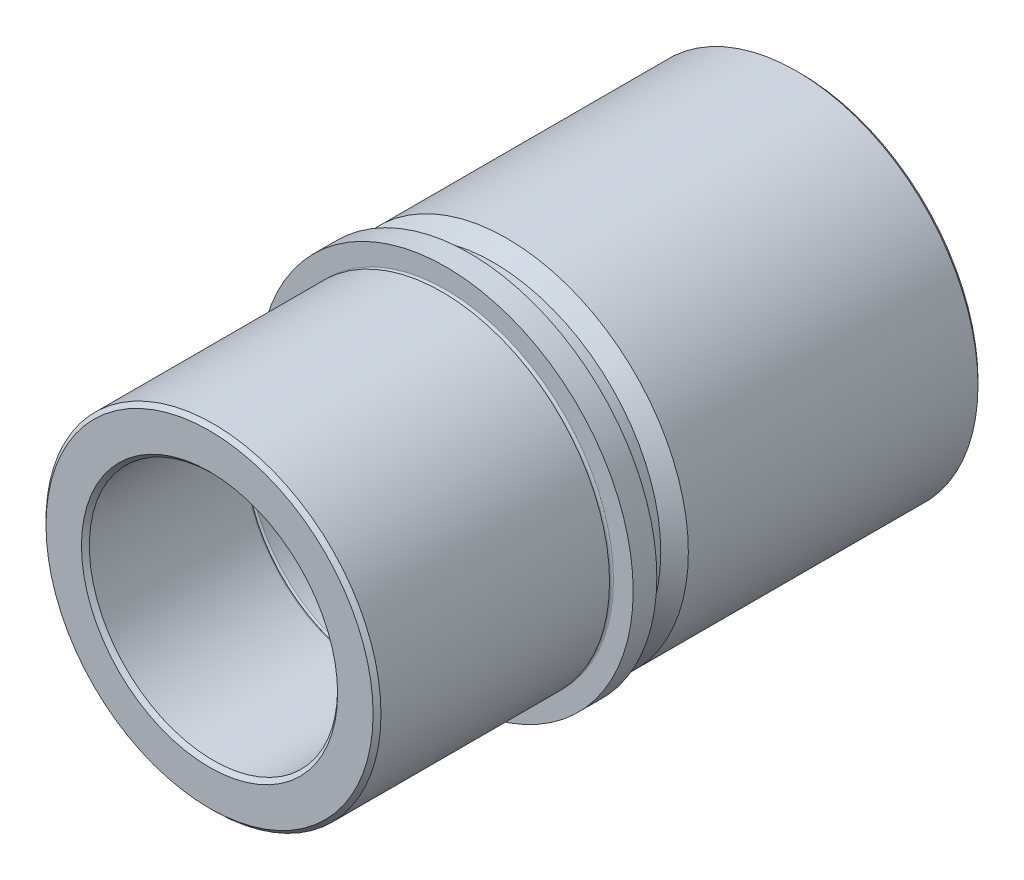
ISO-10303-21;
HEADER;
FILE_DESCRIPTION(('STEP AP214'),'2;1');
FILE_NAME('part.step','',(''),(''),'','','');
FILE_SCHEMA(('AUTOMOTIVE_DESIGN { 1 0 10303 214 1 1 1 1 }'));
ENDSEC;
DATA;
#1=APPLICATION_CONTEXT('core data for automotive mechanical design processes');
#2=APPLICATION_PROTOCOL_DEFINITION('international standard','automotive_design',2000,#1);
#3=PRODUCT_CONTEXT('',#1,'mechanical');
#4=PRODUCT('Part','Part','',(#3));
#5=PRODUCT_RELATED_PRODUCT_CATEGORY('part','',(#4));
#6=PRODUCT_DEFINITION_FORMATION('','',#4);
#7=PRODUCT_DEFINITION_CONTEXT('part definition',#1,'design');
#8=PRODUCT_DEFINITION('design','',#6,#7);
#9=PRODUCT_DEFINITION_SHAPE('','',#8);
#10=(LENGTH_UNIT() NAMED_UNIT(*) SI_UNIT(.MILLI.,.METRE.));
#11=(NAMED_UNIT(*) PLANE_ANGLE_UNIT() SI_UNIT($,.RADIAN.));
#12=(NAMED_UNIT(*) SI_UNIT($,.STERADIAN.) SOLID_ANGLE_UNIT());
#13=UNCERTAINTY_MEASURE_WITH_UNIT(LENGTH_MEASURE(1.E-05),#10,'distance_accuracy_value','');
#14=(GEOMETRIC_REPRESENTATION_CONTEXT(3) GLOBAL_UNCERTAINTY_ASSIGNED_CONTEXT((#13)) GLOBAL_UNIT_ASSIGNED_CONTEXT((#10,
#11,#12)) REPRESENTATION_CONTEXT('',''));
#15=CARTESIAN_POINT('',(0.,0.,0.));
#16=DIRECTION('',(0.,0.,1.));
#17=DIRECTION('',(1.,0.,0.));
#18=AXIS2_PLACEMENT_3D('',#15,#16,#17);
#19=CARTESIAN_POINT('',(0.,0.,-97.5));
#20=DIRECTION('',(0.,0.,1.));
#21=DIRECTION('',(1.,0.,0.));
#22=AXIS2_PLACEMENT_3D('',#19,#20,#21);
#23=TOROIDAL_SURFACE('',#22,32.,0.5);
#24=CARTESIAN_POINT('',(0.,0.,-97.5));
#25=DIRECTION('',(0.,0.,1.));
#26=DIRECTION('',(1.,0.,0.));
#27=AXIS2_PLACEMENT_3D('',#24,#25,#26);
#28=CIRCLE('',#27,31.5);
#29=CARTESIAN_POINT('',(31.5,0.,-97.5));
#30=VERTEX_POINT('',#29);
#31=EDGE_CURVE('E81',#30,#30,#28,.T.);
#32=ORIENTED_EDGE('',*,*,#31,.T.);
#33=EDGE_LOOP('',(#32));
#34=FACE_BOUND('',#33,.T.);
#35=CARTESIAN_POINT('',(0.,0.,-98.));
#36=DIRECTION('',(0.,0.,1.));
#37=DIRECTION('',(1.,0.,0.));
#38=AXIS2_PLACEMENT_3D('',#35,#36,#37);
#39=CIRCLE('',#38,32.);
#40=CARTESIAN_POINT('',(32.,0.,-98.));
#41=VERTEX_POINT('',#40);
#42=EDGE_CURVE('E45',#41,#41,#39,.T.);
#43=ORIENTED_EDGE('',*,*,#42,.F.);
#44=EDGE_LOOP('',(#43));
#45=FACE_BOUND('',#44,.T.);
#46=ADVANCED_FACE('F13',(#34,#45),#23,.T.);
#47=CARTESIAN_POINT('',(0.,0.,-98.5));
#48=DIRECTION('',(0.,0.,1.));
#49=DIRECTION('',(1.,0.,0.));
#50=AXIS2_PLACEMENT_3D('',#47,#48,#49);
#51=TOROIDAL_SURFACE('',#50,32.,0.5);
#52=CARTESIAN_POINT('',(0.,0.,-98.5));
#53=DIRECTION('',(0.,0.,1.));
#54=DIRECTION('',(1.,0.,0.));
#55=AXIS2_PLACEMENT_3D('',#52,#53,#54);
#56=CIRCLE('',#55,31.5);
#57=CARTESIAN_POINT('',(31.5,0.,-98.5));
#58=VERTEX_POINT('',#57);
#59=EDGE_CURVE('E48',#58,#58,#56,.T.);
#60=ORIENTED_EDGE('',*,*,#59,.F.);
#61=EDGE_LOOP('',(#60));
#62=FACE_BOUND('',#61,.T.);
#63=ORIENTED_EDGE('',*,*,#42,.T.);
#64=EDGE_LOOP('',(#63));
#65=FACE_BOUND('',#64,.T.);
#66=ADVANCED_FACE('F113',(#62,#65),#51,.T.);
#67=CARTESIAN_POINT('',(0.,0.,0.));
#68=DIRECTION('',(0.,0.,1.));
#69=DIRECTION('',(1.,0.,0.));
#70=AXIS2_PLACEMENT_3D('',#67,#68,#69);
#71=CYLINDRICAL_SURFACE('',#70,31.5);
#72=CARTESIAN_POINT('',(0.,0.,-149.));
#73=DIRECTION('',(0.,0.,1.));
#74=DIRECTION('',(1.,0.,0.));
#75=AXIS2_PLACEMENT_3D('',#72,#73,#74);
#76=CIRCLE('',#75,31.5);
#77=CARTESIAN_POINT('',(31.5,0.,-149.));
#78=VERTEX_POINT('',#77);
#79=EDGE_CURVE('E36',#78,#78,#76,.F.);
#80=ORIENTED_EDGE('',*,*,#79,.T.);
#81=EDGE_LOOP('',(#80));
#82=FACE_BOUND('',#81,.T.);
#83=ORIENTED_EDGE('',*,*,#59,.T.);
#84=EDGE_LOOP('',(#83));
#85=FACE_BOUND('',#84,.T.);
#86=ADVANCED_FACE('F118',(#82,#85),#71,.F.);
#87=CARTESIAN_POINT('',(0.,0.,-150.));
#88=DIRECTION('',(0.,0.,1.));
#89=DIRECTION('',(1.,0.,0.));
#90=AXIS2_PLACEMENT_3D('',#87,#88,#89);
#91=PLANE('',#90);
#92=CARTESIAN_POINT('',(0.,0.,-150.));
#93=DIRECTION('',(0.,0.,1.));
#94=DIRECTION('',(1.,0.,0.));
#95=AXIS2_PLACEMENT_3D('',#92,#93,#94);
#96=CIRCLE('',#95,32.5);
#97=CARTESIAN_POINT('',(32.5,0.,-150.));
#98=VERTEX_POINT('',#97);
#99=EDGE_CURVE('E39',#98,#98,#96,.T.);
#100=ORIENTED_EDGE('',*,*,#99,.T.);
#101=EDGE_LOOP('',(#100));
#102=FACE_BOUND('',#101,.T.);
#103=CARTESIAN_POINT('',(0.,0.,-150.));
#104=DIRECTION('',(0.,0.,1.));
#105=DIRECTION('',(1.,0.,0.));
#106=AXIS2_PLACEMENT_3D('',#103,#104,#105);
#107=CIRCLE('',#106,45.);
#108=CARTESIAN_POINT('',(45.,0.,-150.));
#109=VERTEX_POINT('',#108);
#110=EDGE_CURVE('E42',#109,#109,#107,.F.);
#111=ORIENTED_EDGE('',*,*,#110,.T.);
#112=EDGE_LOOP('',(#111));
#113=FACE_BOUND('',#112,.T.);
#114=ADVANCED_FACE('F185',(#102,#113),#91,.F.);
#115=CARTESIAN_POINT('',(0.,0.,0.));
#116=DIRECTION('',(0.,0.,1.));
#117=DIRECTION('',(1.,0.,0.));
#118=AXIS2_PLACEMENT_3D('',#115,#116,#117);
#119=CYLINDRICAL_SURFACE('',#118,46.);
#120=CARTESIAN_POINT('',(0.,0.,-149.));
#121=DIRECTION('',(0.,0.,1.));
#122=DIRECTION('',(1.,0.,0.));
#123=AXIS2_PLACEMENT_3D('',#120,#121,#122);
#124=CIRCLE('',#123,46.);
#125=CARTESIAN_POINT('',(46.,0.,-149.));
#126=VERTEX_POINT('',#125);
#127=EDGE_CURVE('E33',#126,#126,#124,.T.);
#128=ORIENTED_EDGE('',*,*,#127,.T.);
#129=EDGE_LOOP('',(#128));
#130=FACE_BOUND('',#129,.T.);
#131=CARTESIAN_POINT('',(0.,0.,-75.5));
#132=DIRECTION('',(0.,0.,1.));
#133=DIRECTION('',(1.,0.,0.));
#134=AXIS2_PLACEMENT_3D('',#131,#132,#133);
#135=CIRCLE('',#134,46.);
#136=CARTESIAN_POINT('',(46.,0.,-75.5));
#137=VERTEX_POINT('',#136);
#138=EDGE_CURVE('E51',#137,#137,#135,.T.);
#139=ORIENTED_EDGE('',*,*,#138,.F.);
#140=EDGE_LOOP('',(#139));
#141=FACE_BOUND('',#140,.T.);
#142=ADVANCED_FACE('F181',(#130,#141),#119,.T.);
#143=CARTESIAN_POINT('',(0.,0.,-72.));
#144=DIRECTION('',(0.,0.,-1.));
#145=DIRECTION('',(-1.,0.,0.));
#146=AXIS2_PLACEMENT_3D('',#143,#144,#145);
#147=CONICAL_SURFACE('',#146,42.5,0.78539816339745);
#148=ORIENTED_EDGE('',*,*,#138,.T.);
#149=EDGE_LOOP('',(#148));
#150=FACE_BOUND('',#149,.T.);
#151=CARTESIAN_POINT('',(0.,0.,-72.));
#152=DIRECTION('',(0.,0.,1.));
#153=DIRECTION('',(1.,0.,0.));
#154=AXIS2_PLACEMENT_3D('',#151,#152,#153);
#155=CIRCLE('',#154,42.5);
#156=CARTESIAN_POINT('',(42.5,0.,-72.));
#157=VERTEX_POINT('',#156);
#158=EDGE_CURVE('E54',#157,#157,#155,.T.);
#159=ORIENTED_EDGE('',*,*,#158,.F.);
#160=EDGE_LOOP('',(#159));
#161=FACE_BOUND('',#160,.T.);
#162=ADVANCED_FACE('F177',(#150,#161),#147,.T.);
#163=CARTESIAN_POINT('',(0.,0.,0.));
#164=DIRECTION('',(0.,0.,1.));
#165=DIRECTION('',(1.,0.,0.));
#166=AXIS2_PLACEMENT_3D('',#163,#164,#165);
#167=CYLINDRICAL_SURFACE('',#166,42.5);
#168=ORIENTED_EDGE('',*,*,#158,.T.);
#169=EDGE_LOOP('',(#168));
#170=FACE_BOUND('',#169,.T.);
#171=CARTESIAN_POINT('',(0.,0.,-66.));
#172=DIRECTION('',(0.,0.,1.));
#173=DIRECTION('',(1.,0.,0.));
#174=AXIS2_PLACEMENT_3D('',#171,#172,#173);
#175=CIRCLE('',#174,42.5);
#176=CARTESIAN_POINT('',(42.5,0.,-66.));
#177=VERTEX_POINT('',#176);
#178=EDGE_CURVE('E57',#177,#177,#175,.T.);
#179=ORIENTED_EDGE('',*,*,#178,.F.);
#180=EDGE_LOOP('',(#179));
#181=FACE_BOUND('',#180,.T.);
#182=ADVANCED_FACE('F173',(#170,#181),#167,.T.);
#183=CARTESIAN_POINT('',(0.,0.,-66.));
#184=DIRECTION('',(0.,0.,-1.));
#185=DIRECTION('',(-1.,0.,0.));
#186=AXIS2_PLACEMENT_3D('',#183,#184,#185);
#187=PLANE('',#186);
#188=ORIENTED_EDGE('',*,*,#178,.T.);
#189=EDGE_LOOP('',(#188));
#190=FACE_BOUND('',#189,.T.);
#191=CARTESIAN_POINT('',(0.,0.,-66.));
#192=DIRECTION('',(0.,0.,1.));
#193=DIRECTION('',(1.,0.,0.));
#194=AXIS2_PLACEMENT_3D('',#191,#192,#193);
#195=CIRCLE('',#194,47.5);
#196=CARTESIAN_POINT('',(47.5,0.,-66.));
#197=VERTEX_POINT('',#196);
#198=EDGE_CURVE('E60',#197,#197,#195,.T.);
#199=ORIENTED_EDGE('',*,*,#198,.F.);
#200=EDGE_LOOP('',(#199));
#201=FACE_BOUND('',#200,.T.);
#202=ADVANCED_FACE('F169',(#190,#201),#187,.T.);
#203=CARTESIAN_POINT('',(0.,0.,0.));
#204=DIRECTION('',(0.,0.,1.));
#205=DIRECTION('',(1.,0.,0.));
#206=AXIS2_PLACEMENT_3D('',#203,#204,#205);
#207=CYLINDRICAL_SURFACE('',#206,47.5);
#208=ORIENTED_EDGE('',*,*,#198,.T.);
#209=EDGE_LOOP('',(#208));
#210=FACE_BOUND('',#209,.T.);
#211=CARTESIAN_POINT('',(0.,0.,-60.));
#212=DIRECTION('',(0.,0.,1.));
#213=DIRECTION('',(1.,0.,0.));
#214=AXIS2_PLACEMENT_3D('',#211,#212,#213);
#215=CIRCLE('',#214,47.5);
#216=CARTESIAN_POINT('',(47.5,0.,-60.));
#217=VERTEX_POINT('',#216);
#218=EDGE_CURVE('E63',#217,#217,#215,.T.);
#219=ORIENTED_EDGE('',*,*,#218,.F.);
#220=EDGE_LOOP('',(#219));
#221=FACE_BOUND('',#220,.T.);
#222=ADVANCED_FACE('F165',(#210,#221),#207,.T.);
#223=CARTESIAN_POINT('',(0.,0.,-60.));
#224=DIRECTION('',(0.,0.,1.));
#225=DIRECTION('',(1.,0.,0.));
#226=AXIS2_PLACEMENT_3D('',#223,#224,#225);
#227=PLANE('',#226);
#228=ORIENTED_EDGE('',*,*,#218,.T.);
#229=EDGE_LOOP('',(#228));
#230=FACE_BOUND('',#229,.T.);
#231=CARTESIAN_POINT('',(0.,0.,-60.));
#232=DIRECTION('',(0.,0.,1.));
#233=DIRECTION('',(1.,0.,0.));
#234=AXIS2_PLACEMENT_3D('',#231,#232,#233);
#235=CIRCLE('',#234,42.5);
#236=CARTESIAN_POINT('',(42.5,0.,-60.));
#237=VERTEX_POINT('',#236);
#238=EDGE_CURVE('E66',#237,#237,#235,.T.);
#239=ORIENTED_EDGE('',*,*,#238,.F.);
#240=EDGE_LOOP('',(#239));
#241=FACE_BOUND('',#240,.T.);
#242=ADVANCED_FACE('F161',(#230,#241),#227,.T.);
#243=CARTESIAN_POINT('',(0.,0.,-59.5));
#244=DIRECTION('',(0.,0.,1.));
#245=DIRECTION('',(1.,0.,0.));
#246=AXIS2_PLACEMENT_3D('',#243,#244,#245);
#247=TOROIDAL_SURFACE('',#246,42.5,0.5);
#248=ORIENTED_EDGE('',*,*,#238,.T.);
#249=EDGE_LOOP('',(#248));
#250=FACE_BOUND('',#249,.T.);
#251=CARTESIAN_POINT('',(0.,0.,-59.));
#252=DIRECTION('',(0.,0.,1.));
#253=DIRECTION('',(1.,0.,0.));
#254=AXIS2_PLACEMENT_3D('',#251,#252,#253);
#255=CIRCLE('',#254,42.5);
#256=CARTESIAN_POINT('',(42.5,0.,-59.));
#257=VERTEX_POINT('',#256);
#258=EDGE_CURVE('E69',#257,#257,#255,.T.);
#259=ORIENTED_EDGE('',*,*,#258,.F.);
#260=EDGE_LOOP('',(#259));
#261=FACE_BOUND('',#260,.T.);
#262=ADVANCED_FACE('F156',(#250,#261),#247,.F.);
#263=CARTESIAN_POINT('',(0.,0.,0.));
#264=DIRECTION('',(0.,0.,1.));
#265=DIRECTION('',(1.,0.,0.));
#266=AXIS2_PLACEMENT_3D('',#263,#264,#265);
#267=CYLINDRICAL_SURFACE('',#266,42.5);
#268=CARTESIAN_POINT('',(0.,0.,-1.));
#269=DIRECTION('',(0.,0.,1.));
#270=DIRECTION('',(1.,0.,0.));
#271=AXIS2_PLACEMENT_3D('',#268,#269,#270);
#272=CIRCLE('',#271,42.5);
#273=CARTESIAN_POINT('',(42.5,0.,-1.));
#274=VERTEX_POINT('',#273);
#275=EDGE_CURVE('E8',#274,#274,#272,.F.);
#276=ORIENTED_EDGE('',*,*,#275,.T.);
#277=EDGE_LOOP('',(#276));
#278=FACE_BOUND('',#277,.T.);
#279=ORIENTED_EDGE('',*,*,#258,.T.);
#280=EDGE_LOOP('',(#279));
#281=FACE_BOUND('',#280,.T.);
#282=ADVANCED_FACE('F149',(#278,#281),#267,.T.);
#283=CARTESIAN_POINT('',(0.,0.,0.));
#284=DIRECTION('',(0.,0.,1.));
#285=DIRECTION('',(1.,0.,0.));
#286=AXIS2_PLACEMENT_3D('',#283,#284,#285);
#287=PLANE('',#286);
#288=CARTESIAN_POINT('',(0.,0.,0.));
#289=DIRECTION('',(0.,0.,1.));
#290=DIRECTION('',(1.,0.,0.));
#291=AXIS2_PLACEMENT_3D('',#288,#289,#290);
#292=CIRCLE('',#291,32.5);
#293=CARTESIAN_POINT('',(32.5,0.,0.));
#294=VERTEX_POINT('',#293);
#295=EDGE_CURVE('E20',#294,#294,#292,.F.);
#296=ORIENTED_EDGE('',*,*,#295,.T.);
#297=EDGE_LOOP('',(#296));
#298=FACE_BOUND('',#297,.T.);
#299=CARTESIAN_POINT('',(0.,0.,0.));
#300=DIRECTION('',(0.,0.,1.));
#301=DIRECTION('',(1.,0.,0.));
#302=AXIS2_PLACEMENT_3D('',#299,#300,#301);
#303=CIRCLE('',#302,41.5);
#304=CARTESIAN_POINT('',(41.5,0.,0.));
#305=VERTEX_POINT('',#304);
#306=EDGE_CURVE('E24',#305,#305,#303,.T.);
#307=ORIENTED_EDGE('',*,*,#306,.T.);
#308=EDGE_LOOP('',(#307));
#309=FACE_BOUND('',#308,.T.);
#310=ADVANCED_FACE('F109',(#298,#309),#287,.T.);
#311=CARTESIAN_POINT('',(0.,0.,0.));
#312=DIRECTION('',(0.,0.,1.));
#313=DIRECTION('',(1.,0.,0.));
#314=AXIS2_PLACEMENT_3D('',#311,#312,#313);
#315=CYLINDRICAL_SURFACE('',#314,31.5);
#316=CARTESIAN_POINT('',(0.,0.,-1.));
#317=DIRECTION('',(0.,0.,1.));
#318=DIRECTION('',(1.,0.,0.));
#319=AXIS2_PLACEMENT_3D('',#316,#317,#318);
#320=CIRCLE('',#319,31.5);
#321=CARTESIAN_POINT('',(31.5,0.,-1.));
#322=VERTEX_POINT('',#321);
#323=EDGE_CURVE('E28',#322,#322,#320,.T.);
#324=ORIENTED_EDGE('',*,*,#323,.T.);
#325=EDGE_LOOP('',(#324));
#326=FACE_BOUND('',#325,.T.);
#327=CARTESIAN_POINT('',(0.,0.,-40.5));
#328=DIRECTION('',(0.,0.,1.));
#329=DIRECTION('',(1.,0.,0.));
#330=AXIS2_PLACEMENT_3D('',#327,#328,#329);
#331=CIRCLE('',#330,31.5);
#332=CARTESIAN_POINT('',(31.5,0.,-40.5));
#333=VERTEX_POINT('',#332);
#334=EDGE_CURVE('E72',#333,#333,#331,.T.);
#335=ORIENTED_EDGE('',*,*,#334,.F.);
#336=EDGE_LOOP('',(#335));
#337=FACE_BOUND('',#336,.T.);
#338=ADVANCED_FACE('F102',(#326,#337),#315,.F.);
#339=CARTESIAN_POINT('',(0.,0.,-40.5));
#340=DIRECTION('',(0.,0.,1.));
#341=DIRECTION('',(1.,0.,0.));
#342=AXIS2_PLACEMENT_3D('',#339,#340,#341);
#343=TOROIDAL_SURFACE('',#342,32.,0.5);
#344=ORIENTED_EDGE('',*,*,#334,.T.);
#345=EDGE_LOOP('',(#344));
#346=FACE_BOUND('',#345,.T.);
#347=CARTESIAN_POINT('',(0.,0.,-41.));
#348=DIRECTION('',(0.,0.,1.));
#349=DIRECTION('',(1.,0.,0.));
#350=AXIS2_PLACEMENT_3D('',#347,#348,#349);
#351=CIRCLE('',#350,32.);
#352=CARTESIAN_POINT('',(32.,0.,-41.));
#353=VERTEX_POINT('',#352);
#354=EDGE_CURVE('E75',#353,#353,#351,.T.);
#355=ORIENTED_EDGE('',*,*,#354,.F.);
#356=EDGE_LOOP('',(#355));
#357=FACE_BOUND('',#356,.T.);
#358=ADVANCED_FACE('F97',(#346,#357),#343,.T.);
#359=CARTESIAN_POINT('',(0.,0.,-41.5));
#360=DIRECTION('',(0.,0.,1.));
#361=DIRECTION('',(1.,0.,0.));
#362=AXIS2_PLACEMENT_3D('',#359,#360,#361);
#363=TOROIDAL_SURFACE('',#362,32.,0.5);
#364=CARTESIAN_POINT('',(0.,0.,-41.5));
#365=DIRECTION('',(0.,0.,1.));
#366=DIRECTION('',(1.,0.,0.));
#367=AXIS2_PLACEMENT_3D('',#364,#365,#366);
#368=CIRCLE('',#367,31.5);
#369=CARTESIAN_POINT('',(31.5,0.,-41.5));
#370=VERTEX_POINT('',#369);
#371=EDGE_CURVE('E78',#370,#370,#368,.T.);
#372=ORIENTED_EDGE('',*,*,#371,.F.);
#373=EDGE_LOOP('',(#372));
#374=FACE_BOUND('',#373,.T.);
#375=ORIENTED_EDGE('',*,*,#354,.T.);
#376=EDGE_LOOP('',(#375));
#377=FACE_BOUND('',#376,.T.);
#378=ADVANCED_FACE('F91',(#374,#377),#363,.T.);
#379=CARTESIAN_POINT('',(0.,0.,0.));
#380=DIRECTION('',(0.,0.,1.));
#381=DIRECTION('',(1.,0.,0.));
#382=AXIS2_PLACEMENT_3D('',#379,#380,#381);
#383=CYLINDRICAL_SURFACE('',#382,31.5);
#384=ORIENTED_EDGE('',*,*,#31,.F.);
#385=EDGE_LOOP('',(#384));
#386=FACE_BOUND('',#385,.T.);
#387=ORIENTED_EDGE('',*,*,#371,.T.);
#388=EDGE_LOOP('',(#387));
#389=FACE_BOUND('',#388,.T.);
#390=ADVANCED_FACE('F87',(#386,#389),#383,.F.);
#391=CARTESIAN_POINT('',(0.,0.,-150.));
#392=DIRECTION('',(0.,0.,-1.));
#393=DIRECTION('',(-1.,0.,0.));
#394=AXIS2_PLACEMENT_3D('',#391,#392,#393);
#395=CONICAL_SURFACE('',#394,32.5,0.785398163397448);
#396=ORIENTED_EDGE('',*,*,#79,.F.);
#397=EDGE_LOOP('',(#396));
#398=FACE_BOUND('',#397,.T.);
#399=ORIENTED_EDGE('',*,*,#99,.F.);
#400=EDGE_LOOP('',(#399));
#401=FACE_BOUND('',#400,.T.);
#402=ADVANCED_FACE('F90',(#398,#401),#395,.F.);
#403=CARTESIAN_POINT('',(0.,0.,-149.));
#404=DIRECTION('',(0.,0.,1.));
#405=DIRECTION('',(1.,0.,0.));
#406=AXIS2_PLACEMENT_3D('',#403,#404,#405);
#407=CONICAL_SURFACE('',#406,46.,0.785398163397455);
#408=ORIENTED_EDGE('',*,*,#110,.F.);
#409=EDGE_LOOP('',(#408));
#410=FACE_BOUND('',#409,.T.);
#411=ORIENTED_EDGE('',*,*,#127,.F.);
#412=EDGE_LOOP('',(#411));
#413=FACE_BOUND('',#412,.T.);
#414=ADVANCED_FACE('F125',(#410,#413),#407,.T.);
#415=CARTESIAN_POINT('',(0.,0.,-1.));
#416=DIRECTION('',(0.,0.,1.));
#417=DIRECTION('',(1.,0.,0.));
#418=AXIS2_PLACEMENT_3D('',#415,#416,#417);
#419=CONICAL_SURFACE('',#418,31.5,0.785398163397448);
#420=ORIENTED_EDGE('',*,*,#295,.F.);
#421=EDGE_LOOP('',(#420));
#422=FACE_BOUND('',#421,.T.);
#423=ORIENTED_EDGE('',*,*,#323,.F.);
#424=EDGE_LOOP('',(#423));
#425=FACE_BOUND('',#424,.T.);
#426=ADVANCED_FACE('F128',(#422,#425),#419,.F.);
#427=CARTESIAN_POINT('',(0.,0.,0.));
#428=DIRECTION('',(0.,0.,-1.));
#429=DIRECTION('',(-1.,0.,0.));
#430=AXIS2_PLACEMENT_3D('',#427,#428,#429);
#431=CONICAL_SURFACE('',#430,41.5,0.785398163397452);
#432=ORIENTED_EDGE('',*,*,#275,.F.);
#433=EDGE_LOOP('',(#432));
#434=FACE_BOUND('',#433,.T.);
#435=ORIENTED_EDGE('',*,*,#306,.F.);
#436=EDGE_LOOP('',(#435));
#437=FACE_BOUND('',#436,.T.);
#438=ADVANCED_FACE('F15',(#434,#437),#431,.T.);
#439=CLOSED_SHELL('',(#46,#66,#86,#114,#142,#162,#182,#202,#222,#242,#262,#282,#310,#338,#358,
#378,#390,#402,#414,#426,#438));
#440=MANIFOLD_SOLID_BREP('B1',#439);
#441=ADVANCED_BREP_SHAPE_REPRESENTATION('',(#18,#440),#14);
#442=SHAPE_DEFINITION_REPRESENTATION(#9,#441);
ENDSEC;
END-ISO-10303-21;
